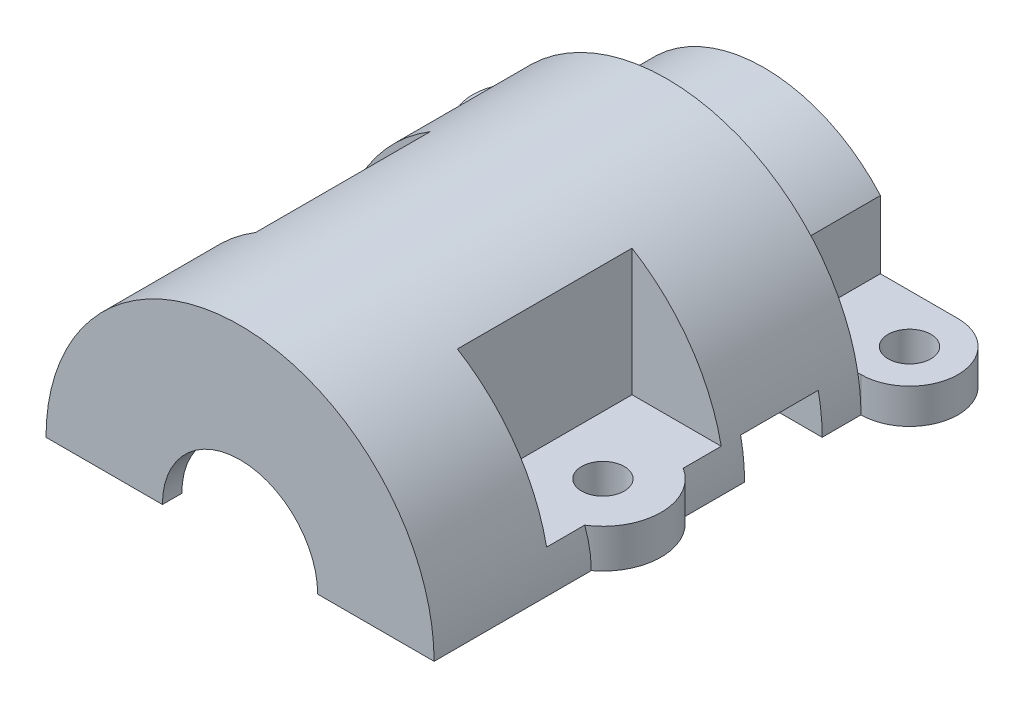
from build123d import *

# Parameters (mm, degrees)
SKETCH1_R               = 12.7
BOSS_EXTRUDE1_DEPTH     = 34.29
SKETCH2_W               = 25.4
SKETCH2_H               = 14.553521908
CUT_EXTRUDE1_DEPTH      = 39.708966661
CUT_EXTRUDE2_START      = -2.54
SKETCH5_W               = 6.073347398
SKETCH5_H               = 11.43
CUT_EXTRUDE2_DEPTH      = 37.168966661
CUT_EXTRUDE3_DEPTH      = 39.708966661
CUT_EXTRUDE3_DEPTH_BACK = 39.708966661
SKETCH6_W               = 5.08
SKETCH6_H               = 2.54
BOSS_EXTRUDE2_REACH     = 40.709
SKETCH7_W               = 6.35
SKETCH7_H               = 8.89
CUT_EXTRUDE5_DEPTH      = 6.35
SKETCH10_W              = 2.217377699
SKETCH10_H              = 5.114348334
CUT_EXTRUDE6_DEPTH      = 6.35
BOSS_EXTRUDE4_DEPTH     = 2.54
SKETCH14_R              = 1.397
CUT_EXTRUDE8_DEPTH      = 40.128574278
SKETCH17_R              = 3.81
BOSS_EXTRUDE5_DEPTH     = 2.54
SKETCH18_W              = 3.81
SKETCH18_H              = 11.43
CUT_EXTRUDE9_DEPTH      = 40.128574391
SKETCH15_R              = 1.397
CUT_EXTRUDE10_DEPTH     = 40.128574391
SKETCH19_W              = 9.830737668
SKETCH19_H              = 6.35
CUT_EXTRUDE11_DEPTH     = 0.254


with BuildPart() as part:
    # Sketch1 → Boss-Extrude1 (new body)
    with BuildSketch(Plane.XY):
        Circle(SKETCH1_R)
    extrude(amount=BOSS_EXTRUDE1_DEPTH)

    # Sketch2 → Cut-Extrude1 (cut, through all)
    with BuildSketch(Plane.XY.offset(34.29)):
        with Locations((0, -7.276760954)):
            Rectangle(SKETCH2_W, SKETCH2_H)
    extrude(amount=-CUT_EXTRUDE1_DEPTH, mode=Mode.SUBTRACT)

    # Sketch3 → Cut-Revolve1 (revolve, cut)
    with BuildSketch(Plane.XZ):
        Polygon((5.08, 34.29), (5.08, 33.02), (7.9375, 33.02), (7.9375, 27.94), (5.588, 27.94), (5.588, 13.97), (9.525, 13.97), (9.525, 8.89), (8.128, 8.89), (8.128, 0), (0, 0), (0, 34.29), align=None)
    revolve(axis=Axis((0, 0, -2.016739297), (0, 0, 1)), mode=Mode.SUBTRACT)

    # Sketch5 → Cut-Extrude2 (cut, through all)
    with BuildSketch(Plane(origin=(0, 0, 0), x_dir=(-1, 0, 0), z_dir=(0, -1, 0)).offset(CUT_EXTRUDE2_START)):
        with Locations((11.164673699, -20.955)):
            Rectangle(SKETCH5_W, SKETCH5_H)
        with Locations((-11.164673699, -20.955)):
            Rectangle(SKETCH5_W, SKETCH5_H)
    extrude(amount=-CUT_EXTRUDE2_DEPTH, mode=Mode.SUBTRACT)

    # Sketch6 → Cut-Extrude3 (cut, two sides: drawn at the far end of the back side and taken through both)
    with BuildSketch(Plane(origin=(0, 0, 0), x_dir=(0, 0, -1), z_dir=(1, 0, 0)).offset(-CUT_EXTRUDE3_DEPTH_BACK)):
        with Locations((-11.43, 1.27)):
            Rectangle(SKETCH6_W, SKETCH6_H)
    extrude(amount=CUT_EXTRUDE3_DEPTH + CUT_EXTRUDE3_DEPTH_BACK, mode=Mode.SUBTRACT)

    # Sketch7 → Boss-Extrude2 (add, up to next)
    with BuildSketch(Plane(origin=(0, 0, 0), x_dir=(-1, 0, 0), z_dir=(0, -1, 0)), mode=Mode.PRIVATE) as boss_extrude2_sk1:
        with Locations((-9.525, -4.445)):
            Rectangle(SKETCH7_W, SKETCH7_H)
    boss_extrude2_tool1 = extrude(boss_extrude2_sk1.sketch, amount=-BOSS_EXTRUDE2_REACH, mode=Mode.PRIVATE) - part.part
    # Sketch7 → Boss-Extrude2 (add, up to next)
    with BuildSketch(Plane(origin=(0, 0, 0), x_dir=(-1, 0, 0), z_dir=(0, -1, 0)), mode=Mode.PRIVATE) as boss_extrude2_sk2:
        with Locations((9.525, -4.445)):
            Rectangle(SKETCH7_W, SKETCH7_H)
    boss_extrude2_tool2 = extrude(boss_extrude2_sk2.sketch, amount=-BOSS_EXTRUDE2_REACH, mode=Mode.PRIVATE) - part.part
    add(boss_extrude2_tool1.solids().sort_by_distance((9.525, 0, 4.445))[0])
    add(boss_extrude2_tool2.solids().sort_by_distance((-9.525, 0, 4.445))[0])

    # Sketch8 → Cut-Extrude5 (cut)
    with BuildSketch(Plane(origin=(0, 0, 0), x_dir=(-1, 0, 0), z_dir=(0, 0, -1))):
        with BuildLine():
            Line((12.443407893, 2.54), (9.837377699, 2.54))
            ThreePointArc((9.837377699, 2.54), (0, 10.16), (-9.837377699, 2.54))
            Line((-9.837377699, 2.54), (-12.443407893, 2.54))
            ThreePointArc((-12.443407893, 2.54), (0, 12.7), (12.443407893, 2.54))
        make_face()
    extrude(amount=-CUT_EXTRUDE5_DEPTH, mode=Mode.SUBTRACT)

    # Sketch10 → Cut-Extrude6 (cut)
    with BuildSketch(Plane(origin=(0, 0, 0), x_dir=(-1, 0, 0), z_dir=(0, 0, -1))):
        with Locations((-8.72868885, 5.097174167)):
            Rectangle(SKETCH10_W, SKETCH10_H)
        with Locations((8.72868885, 5.097174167)):
            Rectangle(SKETCH10_W, SKETCH10_H)
    extrude(amount=-CUT_EXTRUDE6_DEPTH, mode=Mode.SUBTRACT)

    # Sketch13 → Boss-Extrude4 (add)
    with BuildSketch(Plane(origin=(0, 2.54, 0), x_dir=(1, 0, 0), z_dir=(0, 1, 0))):
        with BuildLine():
            Line((-12.7, 0), (-9.210470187, 0))
            Line((-9.210470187, 0), (-9.210470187, -6.35))
            Line((-9.210470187, -6.35), (-12.7, -6.35))
            ThreePointArc((-12.7, -6.35), (-15.875, -3.175), (-12.7, 0))
        make_face()
        with BuildLine():
            Line((10.15064463, 0), (10.15064463, -6.35))
            Line((10.15064463, -6.35), (12.7, -6.35))
            ThreePointArc((12.7, -6.35), (15.875, -3.175), (12.7, 0))
            Line((12.7, 0), (10.15064463, 0))
        make_face()
    extrude(amount=-BOSS_EXTRUDE4_DEPTH)

    # Sketch14 → Cut-Extrude8 (cut, through all)
    with BuildSketch(Plane(origin=(0, 2.54, 0), x_dir=(1, 0, 0), z_dir=(0, 1, 0))):
        with Locations(Location((-12.7, -3.175, 0), (0, 0, 180))):
            Circle(SKETCH14_R)
        with Locations(Location((12.7, -3.175, 0), (0, 0, 180))):
            Circle(SKETCH14_R)
    extrude(amount=-CUT_EXTRUDE8_DEPTH, mode=Mode.SUBTRACT)

    # Sketch17 → Boss-Extrude5 (add)
    with BuildSketch(Plane(origin=(0, 2.54, 0), x_dir=(1, 0, 0), z_dir=(0, 1, 0))):
        with Locations((-10.414, -20.955)):
            Circle(SKETCH17_R)
        with Locations((10.414, -20.955)):
            Circle(SKETCH17_R)
    extrude(amount=-BOSS_EXTRUDE5_DEPTH)

    # Sketch18 → Cut-Extrude9 (cut, through all)
    with BuildSketch(Plane(origin=(0, 2.54, 0), x_dir=(1, 0, 0), z_dir=(0, 1, 0))):
        with Locations((-8.509, -20.955)):
            Rectangle(SKETCH18_W, SKETCH18_H)
        with Locations((8.509, -20.955)):
            Rectangle(SKETCH18_W, SKETCH18_H)
    extrude(amount=CUT_EXTRUDE9_DEPTH, mode=Mode.SUBTRACT)

    # Sketch15 → Cut-Extrude10 (cut, through all)
    with BuildSketch(Plane(origin=(0, 2.54, 0), x_dir=(1, 0, 0), z_dir=(0, 1, 0))):
        with Locations(Location((-10.414, -20.955, 0), (0, 0, 270))):
            Circle(SKETCH15_R)
        with Locations(Location((10.414, -20.955, 0), (0, 0, 90))):
            Circle(SKETCH15_R)
    extrude(amount=-CUT_EXTRUDE10_DEPTH, mode=Mode.SUBTRACT)

    # Sketch19 → Cut-Extrude11 (cut)
    with BuildSketch(Plane(origin=(0, 2.54, 0), x_dir=(1, 0, 0), z_dir=(0, 1, 0))):
        with Locations((12.535368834, -3.175)):
            Rectangle(SKETCH19_W, SKETCH19_H)
        with Locations((-12.535368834, -3.175)):
            Rectangle(SKETCH19_W, SKETCH19_H)
    extrude(amount=-CUT_EXTRUDE11_DEPTH, mode=Mode.SUBTRACT)


solid = part.part
